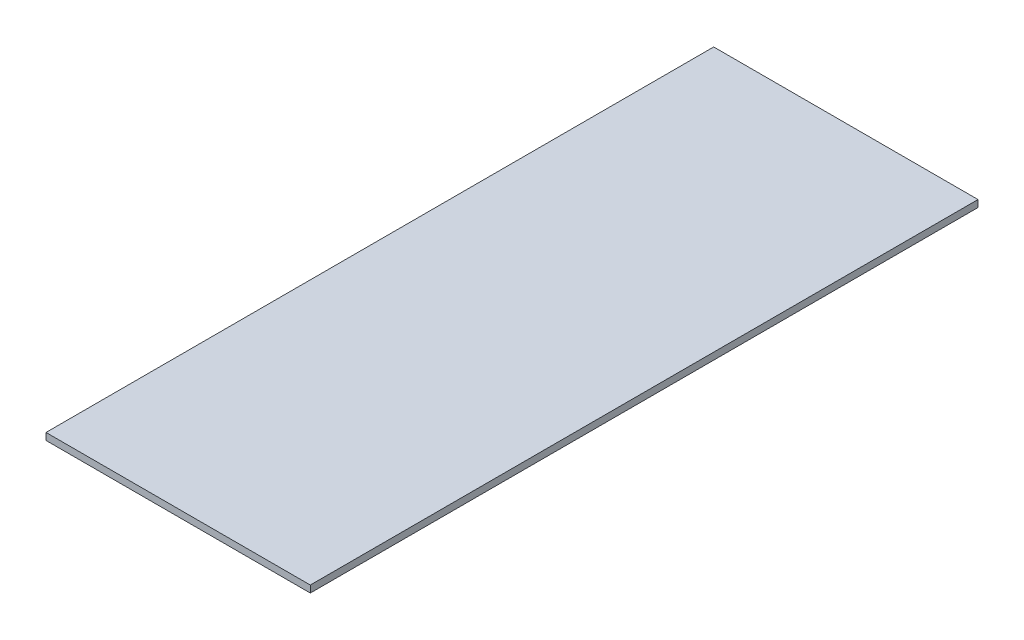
ISO-10303-21;
HEADER;
FILE_DESCRIPTION(('STEP AP214'),'2;1');
FILE_NAME('part.step','',(''),(''),'','','');
FILE_SCHEMA(('AUTOMOTIVE_DESIGN { 1 0 10303 214 1 1 1 1 }'));
ENDSEC;
DATA;
#1=APPLICATION_CONTEXT('core data for automotive mechanical design processes');
#2=APPLICATION_PROTOCOL_DEFINITION('international standard','automotive_design',2000,#1);
#3=PRODUCT_CONTEXT('',#1,'mechanical');
#4=PRODUCT('Part','Part','',(#3));
#5=PRODUCT_RELATED_PRODUCT_CATEGORY('part','',(#4));
#6=PRODUCT_DEFINITION_FORMATION('','',#4);
#7=PRODUCT_DEFINITION_CONTEXT('part definition',#1,'design');
#8=PRODUCT_DEFINITION('design','',#6,#7);
#9=PRODUCT_DEFINITION_SHAPE('','',#8);
#10=(LENGTH_UNIT() NAMED_UNIT(*) SI_UNIT(.MILLI.,.METRE.));
#11=(NAMED_UNIT(*) PLANE_ANGLE_UNIT() SI_UNIT($,.RADIAN.));
#12=(NAMED_UNIT(*) SI_UNIT($,.STERADIAN.) SOLID_ANGLE_UNIT());
#13=UNCERTAINTY_MEASURE_WITH_UNIT(LENGTH_MEASURE(1.E-05),#10,'distance_accuracy_value','');
#14=(GEOMETRIC_REPRESENTATION_CONTEXT(3) GLOBAL_UNCERTAINTY_ASSIGNED_CONTEXT((#13)) GLOBAL_UNIT_ASSIGNED_CONTEXT((#10,
#11,#12)) REPRESENTATION_CONTEXT('',''));
#15=CARTESIAN_POINT('',(0.,0.,0.));
#16=DIRECTION('',(0.,0.,1.));
#17=DIRECTION('',(1.,0.,0.));
#18=AXIS2_PLACEMENT_3D('',#15,#16,#17);
#19=CARTESIAN_POINT('',(0.,4.7625,0.));
#20=DIRECTION('',(1.,0.,0.));
#21=DIRECTION('',(0.,0.,-1.));
#22=AXIS2_PLACEMENT_3D('',#19,#20,#21);
#23=PLANE('',#22);
#24=DIRECTION('',(0.,0.,1.));
#25=VECTOR('',#24,1.);
#26=CARTESIAN_POINT('',(0.,0.,0.));
#27=LINE('',#26,#25);
#28=CARTESIAN_POINT('',(0.,0.,-457.2));
#29=VERTEX_POINT('',#28);
#30=CARTESIAN_POINT('',(0.,0.,0.));
#31=VERTEX_POINT('',#30);
#32=EDGE_CURVE('E96',#29,#31,#27,.T.);
#33=ORIENTED_EDGE('',*,*,#32,.T.);
#34=DIRECTION('',(0.,-1.,0.));
#35=VECTOR('',#34,1.);
#36=CARTESIAN_POINT('',(0.,4.7625,0.));
#37=LINE('',#36,#35);
#38=CARTESIAN_POINT('',(0.,4.7625,0.));
#39=VERTEX_POINT('',#38);
#40=EDGE_CURVE('E11',#39,#31,#37,.T.);
#41=ORIENTED_EDGE('',*,*,#40,.F.);
#42=DIRECTION('',(0.,0.,1.));
#43=VECTOR('',#42,1.);
#44=CARTESIAN_POINT('',(0.,4.7625,0.));
#45=LINE('',#44,#43);
#46=CARTESIAN_POINT('',(0.,4.7625,-457.2));
#47=VERTEX_POINT('',#46);
#48=EDGE_CURVE('E84',#47,#39,#45,.T.);
#49=ORIENTED_EDGE('',*,*,#48,.F.);
#50=DIRECTION('',(0.,-1.,0.));
#51=VECTOR('',#50,1.);
#52=CARTESIAN_POINT('',(0.,4.7625,-457.2));
#53=LINE('',#52,#51);
#54=EDGE_CURVE('E92',#47,#29,#53,.T.);
#55=ORIENTED_EDGE('',*,*,#54,.T.);
#56=EDGE_LOOP('',(#33,#41,#49,#55));
#57=FACE_BOUND('',#56,.T.);
#58=ADVANCED_FACE('F33',(#57),#23,.F.);
#59=CARTESIAN_POINT('',(0.,4.7625,0.));
#60=DIRECTION('',(0.,0.,-1.));
#61=DIRECTION('',(-1.,0.,0.));
#62=AXIS2_PLACEMENT_3D('',#59,#60,#61);
#63=PLANE('',#62);
#64=DIRECTION('',(1.,0.,0.));
#65=VECTOR('',#64,1.);
#66=CARTESIAN_POINT('',(0.,0.,0.));
#67=LINE('',#66,#65);
#68=CARTESIAN_POINT('',(180.975,0.,0.));
#69=VERTEX_POINT('',#68);
#70=EDGE_CURVE('E88',#31,#69,#67,.T.);
#71=ORIENTED_EDGE('',*,*,#70,.T.);
#72=DIRECTION('',(0.,-1.,0.));
#73=VECTOR('',#72,1.);
#74=CARTESIAN_POINT('',(180.975,4.7625,0.));
#75=LINE('',#74,#73);
#76=CARTESIAN_POINT('',(180.975,4.7625,0.));
#77=VERTEX_POINT('',#76);
#78=EDGE_CURVE('E41',#77,#69,#75,.T.);
#79=ORIENTED_EDGE('',*,*,#78,.F.);
#80=DIRECTION('',(1.,0.,0.));
#81=VECTOR('',#80,1.);
#82=CARTESIAN_POINT('',(0.,4.7625,0.));
#83=LINE('',#82,#81);
#84=EDGE_CURVE('E79',#39,#77,#83,.T.);
#85=ORIENTED_EDGE('',*,*,#84,.F.);
#86=ORIENTED_EDGE('',*,*,#40,.T.);
#87=EDGE_LOOP('',(#71,#79,#85,#86));
#88=FACE_BOUND('',#87,.T.);
#89=ADVANCED_FACE('F87',(#88),#63,.F.);
#90=CARTESIAN_POINT('',(180.975,4.7625,0.));
#91=DIRECTION('',(-1.,0.,0.));
#92=DIRECTION('',(0.,0.,1.));
#93=AXIS2_PLACEMENT_3D('',#90,#91,#92);
#94=PLANE('',#93);
#95=DIRECTION('',(0.,0.,-1.));
#96=VECTOR('',#95,1.);
#97=CARTESIAN_POINT('',(180.975,0.,0.));
#98=LINE('',#97,#96);
#99=CARTESIAN_POINT('',(180.975,0.,-457.2));
#100=VERTEX_POINT('',#99);
#101=EDGE_CURVE('E66',#69,#100,#98,.T.);
#102=ORIENTED_EDGE('',*,*,#101,.T.);
#103=DIRECTION('',(0.,-1.,0.));
#104=VECTOR('',#103,1.);
#105=CARTESIAN_POINT('',(180.975,4.7625,-457.2));
#106=LINE('',#105,#104);
#107=CARTESIAN_POINT('',(180.975,4.7625,-457.2));
#108=VERTEX_POINT('',#107);
#109=EDGE_CURVE('E89',#108,#100,#106,.T.);
#110=ORIENTED_EDGE('',*,*,#109,.F.);
#111=DIRECTION('',(0.,0.,-1.));
#112=VECTOR('',#111,1.);
#113=CARTESIAN_POINT('',(180.975,4.7625,0.));
#114=LINE('',#113,#112);
#115=EDGE_CURVE('E82',#77,#108,#114,.T.);
#116=ORIENTED_EDGE('',*,*,#115,.F.);
#117=ORIENTED_EDGE('',*,*,#78,.T.);
#118=EDGE_LOOP('',(#102,#110,#116,#117));
#119=FACE_BOUND('',#118,.T.);
#120=ADVANCED_FACE('F90',(#119),#94,.F.);
#121=CARTESIAN_POINT('',(0.,4.7625,-457.2));
#122=DIRECTION('',(0.,0.,1.));
#123=DIRECTION('',(1.,0.,0.));
#124=AXIS2_PLACEMENT_3D('',#121,#122,#123);
#125=PLANE('',#124);
#126=DIRECTION('',(-1.,0.,0.));
#127=VECTOR('',#126,1.);
#128=CARTESIAN_POINT('',(0.,0.,-457.2));
#129=LINE('',#128,#127);
#130=EDGE_CURVE('E72',#100,#29,#129,.T.);
#131=ORIENTED_EDGE('',*,*,#130,.T.);
#132=ORIENTED_EDGE('',*,*,#54,.F.);
#133=DIRECTION('',(-1.,0.,0.));
#134=VECTOR('',#133,1.);
#135=CARTESIAN_POINT('',(0.,4.7625,-457.2));
#136=LINE('',#135,#134);
#137=EDGE_CURVE('E49',#108,#47,#136,.T.);
#138=ORIENTED_EDGE('',*,*,#137,.F.);
#139=ORIENTED_EDGE('',*,*,#109,.T.);
#140=EDGE_LOOP('',(#131,#132,#138,#139));
#141=FACE_BOUND('',#140,.T.);
#142=ADVANCED_FACE('F103',(#141),#125,.F.);
#143=CARTESIAN_POINT('',(0.,4.7625,0.));
#144=DIRECTION('',(0.,-1.,0.));
#145=DIRECTION('',(0.,0.,-1.));
#146=AXIS2_PLACEMENT_3D('',#143,#144,#145);
#147=PLANE('',#146);
#148=ORIENTED_EDGE('',*,*,#48,.T.);
#149=ORIENTED_EDGE('',*,*,#84,.T.);
#150=ORIENTED_EDGE('',*,*,#115,.T.);
#151=ORIENTED_EDGE('',*,*,#137,.T.);
#152=EDGE_LOOP('',(#148,#149,#150,#151));
#153=FACE_BOUND('',#152,.T.);
#154=ADVANCED_FACE('F80',(#153),#147,.F.);
#155=CARTESIAN_POINT('',(0.,0.,0.));
#156=DIRECTION('',(0.,-1.,0.));
#157=DIRECTION('',(0.,0.,-1.));
#158=AXIS2_PLACEMENT_3D('',#155,#156,#157);
#159=PLANE('',#158);
#160=ORIENTED_EDGE('',*,*,#32,.F.);
#161=ORIENTED_EDGE('',*,*,#130,.F.);
#162=ORIENTED_EDGE('',*,*,#101,.F.);
#163=ORIENTED_EDGE('',*,*,#70,.F.);
#164=EDGE_LOOP('',(#160,#161,#162,#163));
#165=FACE_BOUND('',#164,.T.);
#166=ADVANCED_FACE('F106',(#165),#159,.T.);
#167=CLOSED_SHELL('',(#58,#89,#120,#142,#154,#166));
#168=MANIFOLD_SOLID_BREP('B2',#167);
#169=ADVANCED_BREP_SHAPE_REPRESENTATION('',(#18,#168),#14);
#170=SHAPE_DEFINITION_REPRESENTATION(#9,#169);
ENDSEC;
END-ISO-10303-21;
